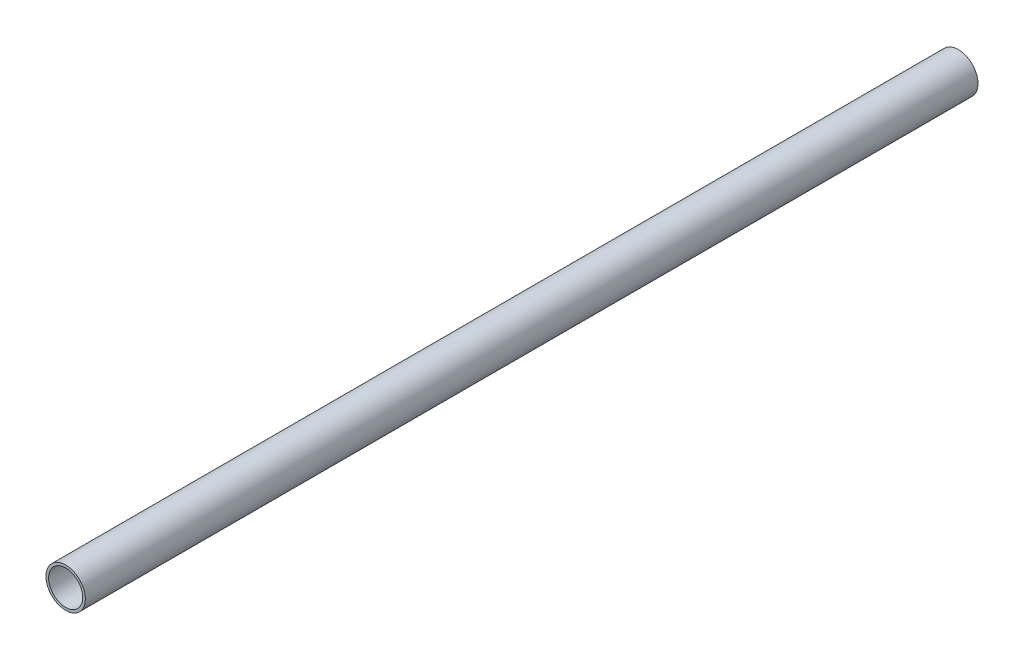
from build123d import *

# Parameters (mm, degrees)
ESQUISSE1_R        = 15
ESQUISSE1_R_2      = 13
BOSS_EXTRU_1_DEPTH = 680


with BuildPart() as part:
    # Esquisse1 → Boss.-Extru.1 (new body)
    with BuildSketch(Plane.XY):
        Circle(ESQUISSE1_R)
        Circle(ESQUISSE1_R_2, mode=Mode.SUBTRACT)
    extrude(amount=BOSS_EXTRU_1_DEPTH)


solid = part.part
